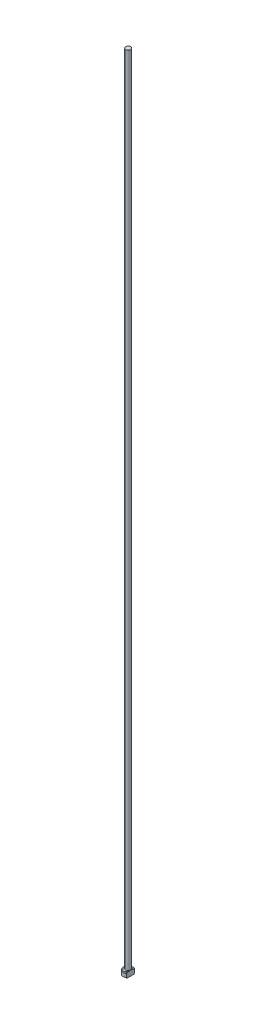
from build123d import *
from build123d.topology import SkipClean

# Parameters (mm, degrees)
CHAMFER1_SIZE = 0.2
FILLET1_R     = 0.2
KEY_DEPTH     = 251.008999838


with BuildPart() as part:
    # Sketch1 → Revolve1 (revolve)
    with BuildSketch(Plane.XY, mode=Mode.PRIVATE) as revolve1_sk:
        Polygon((0, 0), (-1.5, 0), (-1.5, 1.5), (-0.8, 1.5), (-0.8, 250), (0, 250), align=None)
    revolve(revolve1_sk.sketch.rotate(Axis((0, 259.958771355, 0), (0, -1, 0)), 270), axis=Axis((0, 259.958771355, 0), (0, -1, 0)))

    # Chamfer1
    chamfer1_edges = [part.edges().sort_by_distance(p)[0] for p in [
        (0, 1.5, -1.5),
        (0, 0, -1.5),
    ]]
    chamfer(chamfer1_edges, length=CHAMFER1_SIZE)

    # Fillet1
    fillet1_edges = [part.edges().sort_by_distance(p)[0] for p in [
        (0, 1.5, -0.8),
    ]]
    fillet(fillet1_edges, radius=FILLET1_R)

    # Sketch2 → KEY (cut, through all)
    with SkipClean():  # the faces are left unmerged after this step: merging them gives an invalid solid
        with BuildSketch(Plane(origin=(0, 0, 0), x_dir=(1, 0, 0), z_dir=(0, 1, 0))):
            with BuildLine():
                Line((0.8, 1.268857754), (0.8, -1.268857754))
                ThreePointArc((0.8, -1.268857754), (1.5, 0), (0.8, 1.268857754))
            make_face()
        extrude(amount=KEY_DEPTH, mode=Mode.SUBTRACT)


solid = part.part
